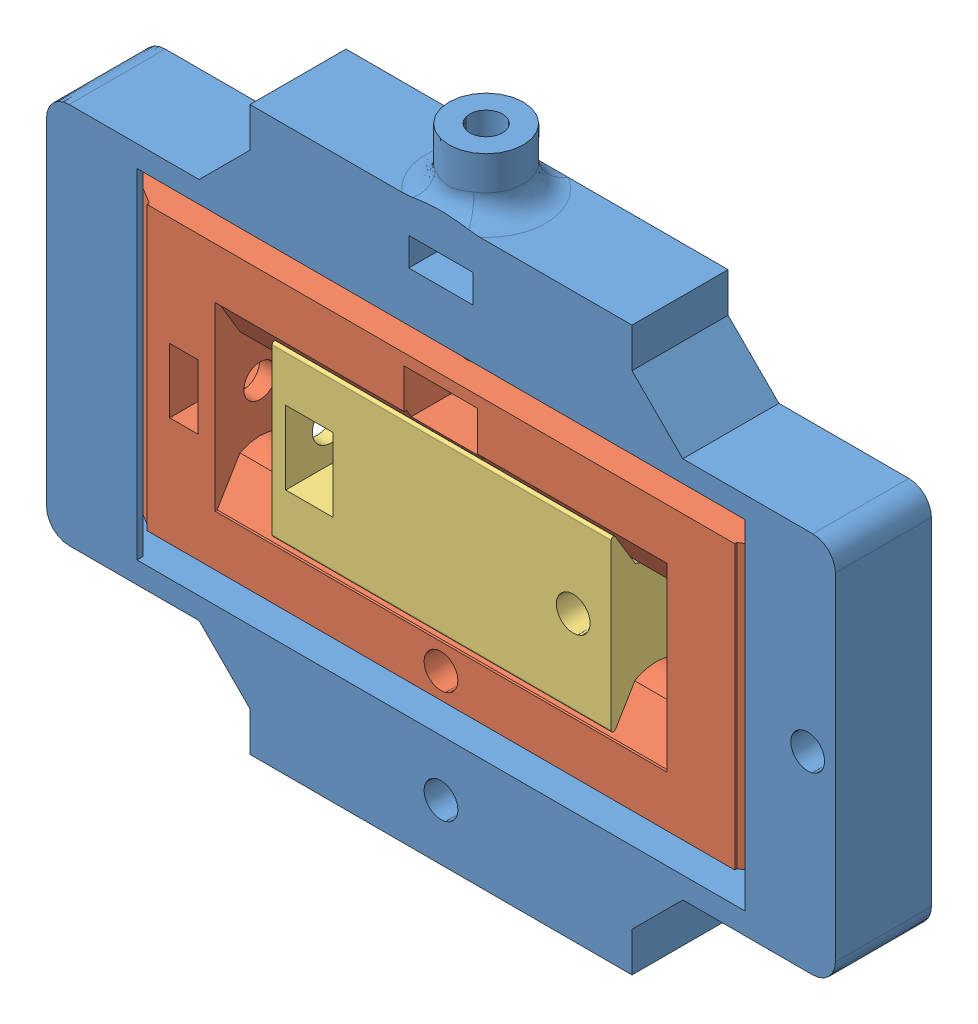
SolidWorks assembly Baugr1_0.15.SLDASM, configuration Standard (file format 15000). Lengths in mm.
Overall size (69.8 54.8 10.5).
3 component instances, 3 part files, 4 mates.
Components (placement in the parent):
- xyStage_inset-1: xyStage_inset.SLDPRT [Standard] at (-0.7234 -2.2365 -5.8866) size (69.8 54.8 8.5)
- xyStage_ySlide-1: xyStage_ySlide.SLDPRT [Standard] at (-0.7234 -14.5454 -1.3866) size (59.6 25 8)
- xyStage_xSlide-1: xyStage_xSlide.SLDPRT [Standard] at (-0.66 -2.0454 -1.3866) x (0 0 -1) z (1 0 0) size (10.5 14.96 30)
Mates (geometry in assembly coordinates):
- Konzentrisch7: concentric anti-aligned: cylinder of xyStage_ySlide-1 through (-20.7234 5.9546 -1.3866) axis (1 0 0) radius 3.8; cylinder of xyStage_xSlide-1 through (14.34 5.9546 -1.3866) axis (-1 0 0) radius 4
- Konzentrisch10: concentric anti-aligned: cylinder of xyStage_ySlide-1 through (-20.7234 -10.0454 -1.3866) axis (1 0 0) radius 3.8; cylinder of xyStage_xSlide-1 through (14.34 -10.0454 -1.3866) axis (-1 0 0) radius 4
- Konzentrisch12: concentric aligned: cylinder of xyStage_inset-1 through (25.2766 73.2945 -1.3866) axis (0 -1 0) radius 4; cylinder of xyStage_ySlide-1 through (25.2766 10.4546 -1.3866) axis (0 -1 0) radius 3.8
- Konzentrisch13: concentric aligned: cylinder of xyStage_inset-1 through (-26.7234 73.2945 -1.3866) axis (0 -1 0) radius 4; cylinder of xyStage_ySlide-1 through (-26.7234 10.4546 -1.3866) axis (0 -1 0) radius 3.8
